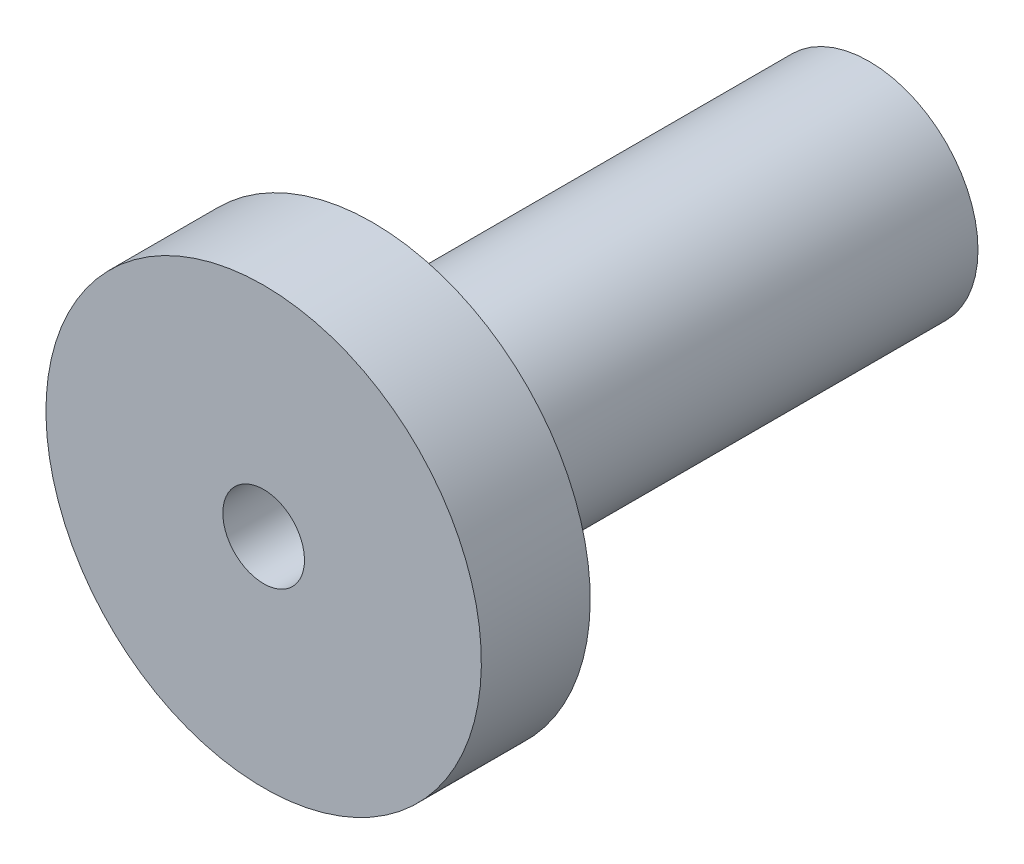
ISO-10303-21;
HEADER;
FILE_DESCRIPTION(('STEP AP214'),'2;1');
FILE_NAME('part.step','',(''),(''),'','','');
FILE_SCHEMA(('AUTOMOTIVE_DESIGN { 1 0 10303 214 1 1 1 1 }'));
ENDSEC;
DATA;
#1=APPLICATION_CONTEXT('core data for automotive mechanical design processes');
#2=APPLICATION_PROTOCOL_DEFINITION('international standard','automotive_design',2000,#1);
#3=PRODUCT_CONTEXT('',#1,'mechanical');
#4=PRODUCT('Part','Part','',(#3));
#5=PRODUCT_RELATED_PRODUCT_CATEGORY('part','',(#4));
#6=PRODUCT_DEFINITION_FORMATION('','',#4);
#7=PRODUCT_DEFINITION_CONTEXT('part definition',#1,'design');
#8=PRODUCT_DEFINITION('design','',#6,#7);
#9=PRODUCT_DEFINITION_SHAPE('','',#8);
#10=(LENGTH_UNIT() NAMED_UNIT(*) SI_UNIT(.MILLI.,.METRE.));
#11=(NAMED_UNIT(*) PLANE_ANGLE_UNIT() SI_UNIT($,.RADIAN.));
#12=(NAMED_UNIT(*) SI_UNIT($,.STERADIAN.) SOLID_ANGLE_UNIT());
#13=UNCERTAINTY_MEASURE_WITH_UNIT(LENGTH_MEASURE(1.E-05),#10,'distance_accuracy_value','');
#14=(GEOMETRIC_REPRESENTATION_CONTEXT(3) GLOBAL_UNCERTAINTY_ASSIGNED_CONTEXT((#13)) GLOBAL_UNIT_ASSIGNED_CONTEXT((#10,
#11,#12)) REPRESENTATION_CONTEXT('',''));
#15=CARTESIAN_POINT('',(0.,0.,0.));
#16=DIRECTION('',(0.,0.,1.));
#17=DIRECTION('',(1.,0.,0.));
#18=AXIS2_PLACEMENT_3D('',#15,#16,#17);
#19=CARTESIAN_POINT('',(0.,0.,-36.5));
#20=DIRECTION('',(0.,0.,-1.));
#21=DIRECTION('',(0.,1.,0.));
#22=AXIS2_PLACEMENT_3D('',#19,#20,#21);
#23=PLANE('',#22);
#24=CARTESIAN_POINT('',(0.,0.,-36.5));
#25=DIRECTION('',(0.,0.,-1.));
#26=DIRECTION('',(0.,1.,0.));
#27=AXIS2_PLACEMENT_3D('',#24,#25,#26);
#28=CIRCLE('',#27,8.);
#29=CARTESIAN_POINT('',(0.,8.,-36.5));
#30=VERTEX_POINT('',#29);
#31=EDGE_CURVE('E8',#30,#30,#28,.T.);
#32=ORIENTED_EDGE('',*,*,#31,.T.);
#33=EDGE_LOOP('',(#32));
#34=FACE_BOUND('',#33,.T.);
#35=ADVANCED_FACE('F12',(#34),#23,.T.);
#36=CARTESIAN_POINT('',(0.,0.,-46.5));
#37=DIRECTION('',(0.,0.,-1.));
#38=DIRECTION('',(0.,1.,0.));
#39=AXIS2_PLACEMENT_3D('',#36,#37,#38);
#40=CYLINDRICAL_SURFACE('',#39,8.);
#41=CARTESIAN_POINT('',(0.,0.,0.));
#42=DIRECTION('',(0.,0.,-1.));
#43=DIRECTION('',(0.,1.,0.));
#44=AXIS2_PLACEMENT_3D('',#41,#42,#43);
#45=CIRCLE('',#44,8.);
#46=CARTESIAN_POINT('',(0.,8.,0.));
#47=VERTEX_POINT('',#46);
#48=EDGE_CURVE('E18',#47,#47,#45,.T.);
#49=ORIENTED_EDGE('',*,*,#48,.T.);
#50=EDGE_LOOP('',(#49));
#51=FACE_BOUND('',#50,.T.);
#52=ORIENTED_EDGE('',*,*,#31,.F.);
#53=EDGE_LOOP('',(#52));
#54=FACE_BOUND('',#53,.T.);
#55=ADVANCED_FACE('F61',(#51,#54),#40,.T.);
#56=CARTESIAN_POINT('',(8.,0.,0.));
#57=DIRECTION('',(0.,0.,-1.));
#58=DIRECTION('',(0.,1.,0.));
#59=AXIS2_PLACEMENT_3D('',#56,#57,#58);
#60=PLANE('',#59);
#61=CARTESIAN_POINT('',(0.,0.,0.));
#62=DIRECTION('',(0.,0.,-1.));
#63=DIRECTION('',(0.,1.,0.));
#64=AXIS2_PLACEMENT_3D('',#61,#62,#63);
#65=CIRCLE('',#64,16.);
#66=CARTESIAN_POINT('',(0.,16.,0.));
#67=VERTEX_POINT('',#66);
#68=EDGE_CURVE('E22',#67,#67,#65,.T.);
#69=ORIENTED_EDGE('',*,*,#68,.T.);
#70=EDGE_LOOP('',(#69));
#71=FACE_BOUND('',#70,.T.);
#72=ORIENTED_EDGE('',*,*,#48,.F.);
#73=EDGE_LOOP('',(#72));
#74=FACE_BOUND('',#73,.T.);
#75=ADVANCED_FACE('F55',(#71,#74),#60,.T.);
#76=CARTESIAN_POINT('',(0.,0.,-46.5));
#77=DIRECTION('',(0.,0.,-1.));
#78=DIRECTION('',(0.,1.,0.));
#79=AXIS2_PLACEMENT_3D('',#76,#77,#78);
#80=CYLINDRICAL_SURFACE('',#79,16.);
#81=CARTESIAN_POINT('',(0.,0.,8.));
#82=DIRECTION('',(0.,0.,-1.));
#83=DIRECTION('',(0.,1.,0.));
#84=AXIS2_PLACEMENT_3D('',#81,#82,#83);
#85=CIRCLE('',#84,16.);
#86=CARTESIAN_POINT('',(0.,16.,8.));
#87=VERTEX_POINT('',#86);
#88=EDGE_CURVE('E26',#87,#87,#85,.T.);
#89=ORIENTED_EDGE('',*,*,#88,.T.);
#90=EDGE_LOOP('',(#89));
#91=FACE_BOUND('',#90,.T.);
#92=ORIENTED_EDGE('',*,*,#68,.F.);
#93=EDGE_LOOP('',(#92));
#94=FACE_BOUND('',#93,.T.);
#95=ADVANCED_FACE('F49',(#91,#94),#80,.T.);
#96=CARTESIAN_POINT('',(16.,0.,8.));
#97=DIRECTION('',(0.,0.,1.));
#98=DIRECTION('',(0.,-1.,0.));
#99=AXIS2_PLACEMENT_3D('',#96,#97,#98);
#100=PLANE('',#99);
#101=CARTESIAN_POINT('',(0.,0.,8.));
#102=DIRECTION('',(0.,0.,1.));
#103=DIRECTION('',(0.,-1.,0.));
#104=AXIS2_PLACEMENT_3D('',#101,#102,#103);
#105=CIRCLE('',#104,3.);
#106=CARTESIAN_POINT('',(0.,-3.,8.));
#107=VERTEX_POINT('',#106);
#108=EDGE_CURVE('E32',#107,#107,#105,.T.);
#109=ORIENTED_EDGE('',*,*,#108,.F.);
#110=EDGE_LOOP('',(#109));
#111=FACE_BOUND('',#110,.T.);
#112=ORIENTED_EDGE('',*,*,#88,.F.);
#113=EDGE_LOOP('',(#112));
#114=FACE_BOUND('',#113,.T.);
#115=ADVANCED_FACE('F43',(#111,#114),#100,.T.);
#116=CARTESIAN_POINT('',(0.,0.,-24.5));
#117=DIRECTION('',(0.,0.,1.));
#118=DIRECTION('',(0.,-1.,0.));
#119=AXIS2_PLACEMENT_3D('',#116,#117,#118);
#120=CYLINDRICAL_SURFACE('',#119,3.);
#121=CARTESIAN_POINT('',(0.,0.,-24.5));
#122=DIRECTION('',(0.,0.,1.));
#123=DIRECTION('',(0.,-1.,0.));
#124=AXIS2_PLACEMENT_3D('',#121,#122,#123);
#125=CIRCLE('',#124,3.);
#126=CARTESIAN_POINT('',(0.,-3.,-24.5));
#127=VERTEX_POINT('',#126);
#128=EDGE_CURVE('E31',#127,#127,#125,.T.);
#129=ORIENTED_EDGE('',*,*,#128,.F.);
#130=EDGE_LOOP('',(#129));
#131=FACE_BOUND('',#130,.T.);
#132=ORIENTED_EDGE('',*,*,#108,.T.);
#133=EDGE_LOOP('',(#132));
#134=FACE_BOUND('',#133,.T.);
#135=ADVANCED_FACE('F40',(#131,#134),#120,.F.);
#136=CARTESIAN_POINT('',(0.,0.,-24.5));
#137=DIRECTION('',(0.,0.,1.));
#138=DIRECTION('',(0.,-1.,0.));
#139=AXIS2_PLACEMENT_3D('',#136,#137,#138);
#140=PLANE('',#139);
#141=ORIENTED_EDGE('',*,*,#128,.T.);
#142=EDGE_LOOP('',(#141));
#143=FACE_BOUND('',#142,.T.);
#144=ADVANCED_FACE('F38',(#143),#140,.T.);
#145=CLOSED_SHELL('',(#35,#55,#75,#95,#115,#135,#144));
#146=MANIFOLD_SOLID_BREP('B1',#145);
#147=ADVANCED_BREP_SHAPE_REPRESENTATION('',(#18,#146),#14);
#148=SHAPE_DEFINITION_REPRESENTATION(#9,#147);
ENDSEC;
END-ISO-10303-21;
